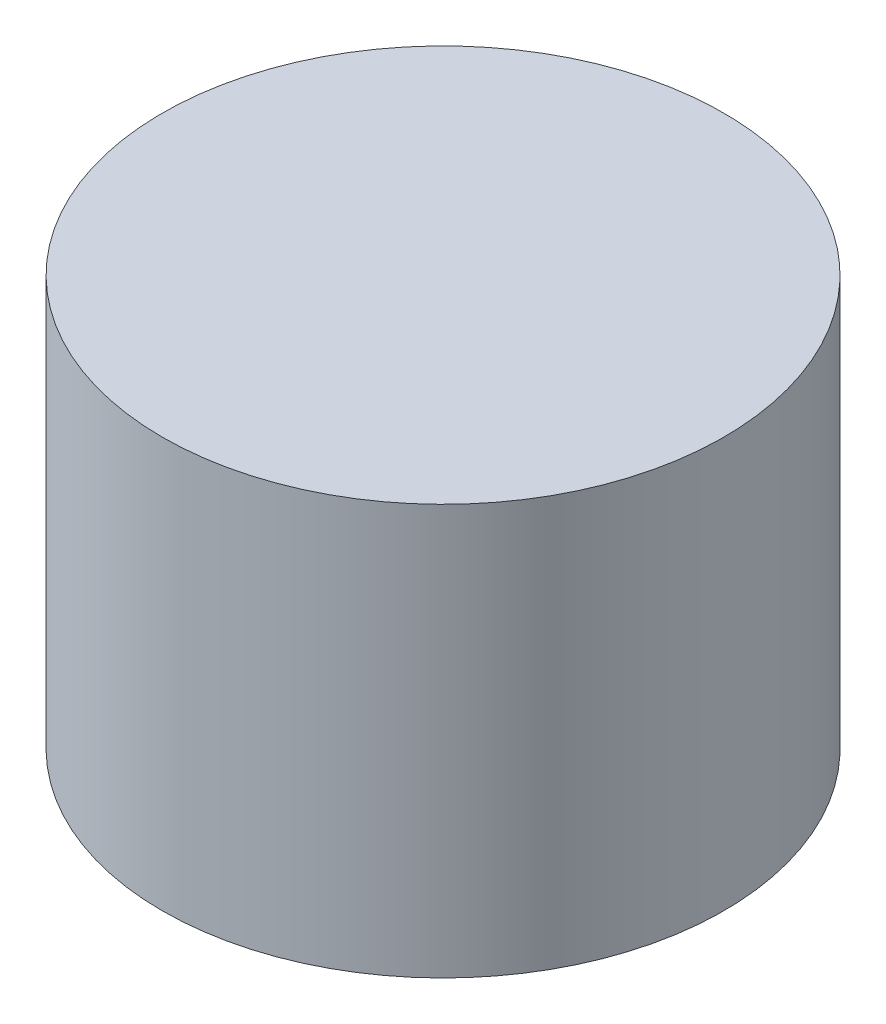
ISO-10303-21;
HEADER;
FILE_DESCRIPTION(('STEP AP214'),'2;1');
FILE_NAME('part.step','',(''),(''),'','','');
FILE_SCHEMA(('AUTOMOTIVE_DESIGN { 1 0 10303 214 1 1 1 1 }'));
ENDSEC;
DATA;
#1=APPLICATION_CONTEXT('core data for automotive mechanical design processes');
#2=APPLICATION_PROTOCOL_DEFINITION('international standard','automotive_design',2000,#1);
#3=PRODUCT_CONTEXT('',#1,'mechanical');
#4=PRODUCT('Part','Part','',(#3));
#5=PRODUCT_RELATED_PRODUCT_CATEGORY('part','',(#4));
#6=PRODUCT_DEFINITION_FORMATION('','',#4);
#7=PRODUCT_DEFINITION_CONTEXT('part definition',#1,'design');
#8=PRODUCT_DEFINITION('design','',#6,#7);
#9=PRODUCT_DEFINITION_SHAPE('','',#8);
#10=(LENGTH_UNIT() NAMED_UNIT(*) SI_UNIT(.MILLI.,.METRE.));
#11=(NAMED_UNIT(*) PLANE_ANGLE_UNIT() SI_UNIT($,.RADIAN.));
#12=(NAMED_UNIT(*) SI_UNIT($,.STERADIAN.) SOLID_ANGLE_UNIT());
#13=UNCERTAINTY_MEASURE_WITH_UNIT(LENGTH_MEASURE(1.E-05),#10,'distance_accuracy_value','');
#14=(GEOMETRIC_REPRESENTATION_CONTEXT(3) GLOBAL_UNCERTAINTY_ASSIGNED_CONTEXT((#13)) GLOBAL_UNIT_ASSIGNED_CONTEXT((#10,
#11,#12)) REPRESENTATION_CONTEXT('',''));
#15=CARTESIAN_POINT('',(0.,0.,0.));
#16=DIRECTION('',(0.,0.,1.));
#17=DIRECTION('',(1.,0.,0.));
#18=AXIS2_PLACEMENT_3D('',#15,#16,#17);
#19=CARTESIAN_POINT('',(0.,10.96,0.));
#20=DIRECTION('',(0.,-1.,0.));
#21=DIRECTION('',(0.,0.,-1.));
#22=AXIS2_PLACEMENT_3D('',#19,#20,#21);
#23=CYLINDRICAL_SURFACE('',#22,15.);
#24=CARTESIAN_POINT('',(0.,10.96,0.));
#25=DIRECTION('',(0.,1.,0.));
#26=DIRECTION('',(0.,0.,1.));
#27=AXIS2_PLACEMENT_3D('',#24,#25,#26);
#28=CIRCLE('',#27,15.);
#29=CARTESIAN_POINT('',(0.,10.96,15.));
#30=VERTEX_POINT('',#29);
#31=EDGE_CURVE('E10',#30,#30,#28,.T.);
#32=ORIENTED_EDGE('',*,*,#31,.F.);
#33=EDGE_LOOP('',(#32));
#34=FACE_BOUND('',#33,.T.);
#35=CARTESIAN_POINT('',(0.,-10.96,0.));
#36=DIRECTION('',(0.,1.,0.));
#37=DIRECTION('',(0.,0.,1.));
#38=AXIS2_PLACEMENT_3D('',#35,#36,#37);
#39=CIRCLE('',#38,15.);
#40=CARTESIAN_POINT('',(0.,-10.96,15.));
#41=VERTEX_POINT('',#40);
#42=EDGE_CURVE('E44',#41,#41,#39,.T.);
#43=ORIENTED_EDGE('',*,*,#42,.T.);
#44=EDGE_LOOP('',(#43));
#45=FACE_BOUND('',#44,.T.);
#46=ADVANCED_FACE('F41',(#34,#45),#23,.T.);
#47=CARTESIAN_POINT('',(0.,10.96,0.));
#48=DIRECTION('',(0.,1.,0.));
#49=DIRECTION('',(0.,0.,1.));
#50=AXIS2_PLACEMENT_3D('',#47,#48,#49);
#51=PLANE('',#50);
#52=ORIENTED_EDGE('',*,*,#31,.T.);
#53=EDGE_LOOP('',(#52));
#54=FACE_BOUND('',#53,.T.);
#55=ADVANCED_FACE('F56',(#54),#51,.T.);
#56=CARTESIAN_POINT('',(0.,-10.96,0.));
#57=DIRECTION('',(0.,1.,0.));
#58=DIRECTION('',(0.,0.,1.));
#59=AXIS2_PLACEMENT_3D('',#56,#57,#58);
#60=PLANE('',#59);
#61=ORIENTED_EDGE('',*,*,#42,.F.);
#62=EDGE_LOOP('',(#61));
#63=FACE_BOUND('',#62,.T.);
#64=ADVANCED_FACE('F54',(#63),#60,.F.);
#65=CLOSED_SHELL('',(#46,#55,#64));
#66=MANIFOLD_SOLID_BREP('B2',#65);
#67=ADVANCED_BREP_SHAPE_REPRESENTATION('',(#18,#66),#14);
#68=SHAPE_DEFINITION_REPRESENTATION(#9,#67);
ENDSEC;
END-ISO-10303-21;
